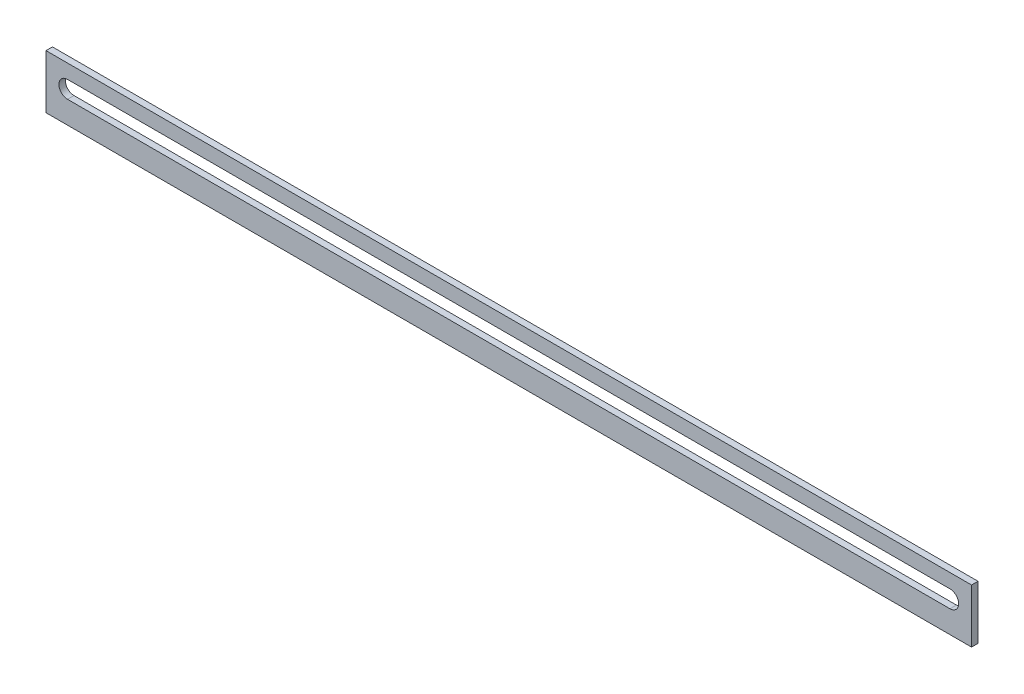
ISO-10303-21;
HEADER;
FILE_DESCRIPTION(('STEP AP214'),'2;1');
FILE_NAME('part.step','',(''),(''),'','','');
FILE_SCHEMA(('AUTOMOTIVE_DESIGN { 1 0 10303 214 1 1 1 1 }'));
ENDSEC;
DATA;
#1=APPLICATION_CONTEXT('core data for automotive mechanical design processes');
#2=APPLICATION_PROTOCOL_DEFINITION('international standard','automotive_design',2000,#1);
#3=PRODUCT_CONTEXT('',#1,'mechanical');
#4=PRODUCT('Part','Part','',(#3));
#5=PRODUCT_RELATED_PRODUCT_CATEGORY('part','',(#4));
#6=PRODUCT_DEFINITION_FORMATION('','',#4);
#7=PRODUCT_DEFINITION_CONTEXT('part definition',#1,'design');
#8=PRODUCT_DEFINITION('design','',#6,#7);
#9=PRODUCT_DEFINITION_SHAPE('','',#8);
#10=(LENGTH_UNIT() NAMED_UNIT(*) SI_UNIT(.MILLI.,.METRE.));
#11=(NAMED_UNIT(*) PLANE_ANGLE_UNIT() SI_UNIT($,.RADIAN.));
#12=(NAMED_UNIT(*) SI_UNIT($,.STERADIAN.) SOLID_ANGLE_UNIT());
#13=UNCERTAINTY_MEASURE_WITH_UNIT(LENGTH_MEASURE(1.E-05),#10,'distance_accuracy_value','');
#14=(GEOMETRIC_REPRESENTATION_CONTEXT(3) GLOBAL_UNCERTAINTY_ASSIGNED_CONTEXT((#13)) GLOBAL_UNIT_ASSIGNED_CONTEXT((#10,
#11,#12)) REPRESENTATION_CONTEXT('',''));
#15=CARTESIAN_POINT('',(0.,0.,0.));
#16=DIRECTION('',(0.,0.,1.));
#17=DIRECTION('',(1.,0.,0.));
#18=AXIS2_PLACEMENT_3D('',#15,#16,#17);
#19=CARTESIAN_POINT('',(373.84952654,7.14159266,1.5));
#20=DIRECTION('',(0.,0.,-1.));
#21=DIRECTION('',(0.,1.,0.));
#22=AXIS2_PLACEMENT_3D('',#19,#20,#21);
#23=PLANE('',#22);
#24=DIRECTION('',(-1.,0.,0.));
#25=VECTOR('',#24,1.);
#26=CARTESIAN_POINT('',(-29.64603306,-9.41999999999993,1.5));
#27=LINE('',#26,#25);
#28=CARTESIAN_POINT('',(400.35396694,-9.41999999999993,1.5));
#29=VERTEX_POINT('',#28);
#30=CARTESIAN_POINT('',(-29.64603306,-9.41999999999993,1.5));
#31=VERTEX_POINT('',#30);
#32=EDGE_CURVE('E152',#29,#31,#27,.T.);
#33=ORIENTED_EDGE('',*,*,#32,.T.);
#34=DIRECTION('',(0.,-1.,0.));
#35=VECTOR('',#34,1.);
#36=CARTESIAN_POINT('',(-29.64603306,-34.4199999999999,1.5));
#37=LINE('',#36,#35);
#38=CARTESIAN_POINT('',(-29.64603306,-34.4199999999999,1.5));
#39=VERTEX_POINT('',#38);
#40=EDGE_CURVE('E154',#31,#39,#37,.T.);
#41=ORIENTED_EDGE('',*,*,#40,.T.);
#42=DIRECTION('',(1.,0.,0.));
#43=VECTOR('',#42,1.);
#44=CARTESIAN_POINT('',(-29.64603306,-34.4199999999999,1.5));
#45=LINE('',#44,#43);
#46=CARTESIAN_POINT('',(400.35396694,-34.4199999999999,1.5));
#47=VERTEX_POINT('',#46);
#48=EDGE_CURVE('E142',#39,#47,#45,.T.);
#49=ORIENTED_EDGE('',*,*,#48,.T.);
#50=DIRECTION('',(0.,1.,0.));
#51=VECTOR('',#50,1.);
#52=CARTESIAN_POINT('',(400.35396694,-34.4199999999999,1.5));
#53=LINE('',#52,#51);
#54=EDGE_CURVE('E134',#47,#29,#53,.T.);
#55=ORIENTED_EDGE('',*,*,#54,.T.);
#56=EDGE_LOOP('',(#33,#41,#49,#55));
#57=FACE_BOUND('',#56,.T.);
#58=DIRECTION('',(1.,0.,0.));
#59=VECTOR('',#58,1.);
#60=CARTESIAN_POINT('',(-19.64603306,-24.,1.5));
#61=LINE('',#60,#59);
#62=CARTESIAN_POINT('',(-19.64603306,-24.,1.5));
#63=VERTEX_POINT('',#62);
#64=CARTESIAN_POINT('',(390.35396694,-24.,1.5));
#65=VERTEX_POINT('',#64);
#66=EDGE_CURVE('E128',#63,#65,#61,.T.);
#67=ORIENTED_EDGE('',*,*,#66,.F.);
#68=CARTESIAN_POINT('',(-19.64603306,-20.,1.5));
#69=DIRECTION('',(0.,0.,1.));
#70=DIRECTION('',(1.,0.,0.));
#71=AXIS2_PLACEMENT_3D('',#68,#69,#70);
#72=CIRCLE('',#71,4.);
#73=CARTESIAN_POINT('',(-19.64603306,-16.,1.5));
#74=VERTEX_POINT('',#73);
#75=EDGE_CURVE('E61',#74,#63,#72,.T.);
#76=ORIENTED_EDGE('',*,*,#75,.F.);
#77=DIRECTION('',(-1.,0.,0.));
#78=VECTOR('',#77,1.);
#79=CARTESIAN_POINT('',(-19.64603306,-16.,1.5));
#80=LINE('',#79,#78);
#81=CARTESIAN_POINT('',(390.35396694,-16.,1.5));
#82=VERTEX_POINT('',#81);
#83=EDGE_CURVE('E119',#82,#74,#80,.T.);
#84=ORIENTED_EDGE('',*,*,#83,.F.);
#85=CARTESIAN_POINT('',(390.35396694,-20.,1.5));
#86=DIRECTION('',(0.,0.,1.));
#87=DIRECTION('',(1.,0.,0.));
#88=AXIS2_PLACEMENT_3D('',#85,#86,#87);
#89=CIRCLE('',#88,4.);
#90=EDGE_CURVE('E122',#65,#82,#89,.T.);
#91=ORIENTED_EDGE('',*,*,#90,.F.);
#92=EDGE_LOOP('',(#67,#76,#84,#91));
#93=FACE_BOUND('',#92,.T.);
#94=ADVANCED_FACE('F37',(#57,#93),#23,.F.);
#95=CARTESIAN_POINT('',(373.84952654,7.14159266,-1.5));
#96=DIRECTION('',(0.,0.,1.));
#97=DIRECTION('',(0.,-1.,0.));
#98=AXIS2_PLACEMENT_3D('',#95,#96,#97);
#99=PLANE('',#98);
#100=DIRECTION('',(0.,-1.,0.));
#101=VECTOR('',#100,1.);
#102=CARTESIAN_POINT('',(-29.64603306,-34.4199999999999,-1.5));
#103=LINE('',#102,#101);
#104=CARTESIAN_POINT('',(-29.64603306,-9.41999999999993,-1.5));
#105=VERTEX_POINT('',#104);
#106=CARTESIAN_POINT('',(-29.64603306,-34.4199999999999,-1.5));
#107=VERTEX_POINT('',#106);
#108=EDGE_CURVE('E144',#105,#107,#103,.T.);
#109=ORIENTED_EDGE('',*,*,#108,.F.);
#110=DIRECTION('',(-1.,0.,0.));
#111=VECTOR('',#110,1.);
#112=CARTESIAN_POINT('',(-29.64603306,-9.41999999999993,-1.5));
#113=LINE('',#112,#111);
#114=CARTESIAN_POINT('',(400.35396694,-9.41999999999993,-1.5));
#115=VERTEX_POINT('',#114);
#116=EDGE_CURVE('E141',#115,#105,#113,.T.);
#117=ORIENTED_EDGE('',*,*,#116,.F.);
#118=DIRECTION('',(0.,1.,0.));
#119=VECTOR('',#118,1.);
#120=CARTESIAN_POINT('',(400.35396694,-34.4199999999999,-1.5));
#121=LINE('',#120,#119);
#122=CARTESIAN_POINT('',(400.35396694,-34.4199999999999,-1.5));
#123=VERTEX_POINT('',#122);
#124=EDGE_CURVE('E138',#123,#115,#121,.T.);
#125=ORIENTED_EDGE('',*,*,#124,.F.);
#126=DIRECTION('',(1.,0.,0.));
#127=VECTOR('',#126,1.);
#128=CARTESIAN_POINT('',(-29.64603306,-34.4199999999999,-1.5));
#129=LINE('',#128,#127);
#130=EDGE_CURVE('E147',#107,#123,#129,.T.);
#131=ORIENTED_EDGE('',*,*,#130,.F.);
#132=EDGE_LOOP('',(#109,#117,#125,#131));
#133=FACE_BOUND('',#132,.T.);
#134=CARTESIAN_POINT('',(-19.64603306,-20.,-1.5));
#135=DIRECTION('',(0.,0.,1.));
#136=DIRECTION('',(1.,0.,0.));
#137=AXIS2_PLACEMENT_3D('',#134,#135,#136);
#138=CIRCLE('',#137,4.);
#139=CARTESIAN_POINT('',(-19.64603306,-16.,-1.5));
#140=VERTEX_POINT('',#139);
#141=CARTESIAN_POINT('',(-19.64603306,-24.,-1.5));
#142=VERTEX_POINT('',#141);
#143=EDGE_CURVE('E104',#140,#142,#138,.T.);
#144=ORIENTED_EDGE('',*,*,#143,.T.);
#145=DIRECTION('',(1.,0.,0.));
#146=VECTOR('',#145,1.);
#147=CARTESIAN_POINT('',(-19.64603306,-24.,-1.5));
#148=LINE('',#147,#146);
#149=CARTESIAN_POINT('',(390.35396694,-24.,-1.5));
#150=VERTEX_POINT('',#149);
#151=EDGE_CURVE('E113',#142,#150,#148,.T.);
#152=ORIENTED_EDGE('',*,*,#151,.T.);
#153=CARTESIAN_POINT('',(390.35396694,-20.,-1.5));
#154=DIRECTION('',(0.,0.,1.));
#155=DIRECTION('',(1.,0.,0.));
#156=AXIS2_PLACEMENT_3D('',#153,#154,#155);
#157=CIRCLE('',#156,4.);
#158=CARTESIAN_POINT('',(390.35396694,-16.,-1.5));
#159=VERTEX_POINT('',#158);
#160=EDGE_CURVE('E53',#150,#159,#157,.T.);
#161=ORIENTED_EDGE('',*,*,#160,.T.);
#162=DIRECTION('',(-1.,0.,0.));
#163=VECTOR('',#162,1.);
#164=CARTESIAN_POINT('',(-19.64603306,-16.,-1.5));
#165=LINE('',#164,#163);
#166=EDGE_CURVE('E110',#159,#140,#165,.T.);
#167=ORIENTED_EDGE('',*,*,#166,.T.);
#168=EDGE_LOOP('',(#144,#152,#161,#167));
#169=FACE_BOUND('',#168,.T.);
#170=ADVANCED_FACE('F117',(#133,#169),#99,.F.);
#171=CARTESIAN_POINT('',(-29.64603306,-9.41999999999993,-1.5));
#172=DIRECTION('',(0.,1.,0.));
#173=DIRECTION('',(0.,0.,1.));
#174=AXIS2_PLACEMENT_3D('',#171,#172,#173);
#175=PLANE('',#174);
#176=ORIENTED_EDGE('',*,*,#116,.T.);
#177=DIRECTION('',(0.,0.,1.));
#178=VECTOR('',#177,1.);
#179=CARTESIAN_POINT('',(-29.64603306,-9.41999999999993,-1.5));
#180=LINE('',#179,#178);
#181=EDGE_CURVE('E159',#105,#31,#180,.T.);
#182=ORIENTED_EDGE('',*,*,#181,.T.);
#183=ORIENTED_EDGE('',*,*,#32,.F.);
#184=DIRECTION('',(0.,0.,1.));
#185=VECTOR('',#184,1.);
#186=CARTESIAN_POINT('',(400.35396694,-9.41999999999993,-1.5));
#187=LINE('',#186,#185);
#188=EDGE_CURVE('E40',#115,#29,#187,.T.);
#189=ORIENTED_EDGE('',*,*,#188,.F.);
#190=EDGE_LOOP('',(#176,#182,#183,#189));
#191=FACE_BOUND('',#190,.T.);
#192=ADVANCED_FACE('F170',(#191),#175,.T.);
#193=CARTESIAN_POINT('',(400.35396694,-34.4199999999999,-1.5));
#194=DIRECTION('',(1.,0.,0.));
#195=DIRECTION('',(0.,0.,-1.));
#196=AXIS2_PLACEMENT_3D('',#193,#194,#195);
#197=PLANE('',#196);
#198=ORIENTED_EDGE('',*,*,#54,.F.);
#199=DIRECTION('',(0.,0.,1.));
#200=VECTOR('',#199,1.);
#201=CARTESIAN_POINT('',(400.35396694,-34.4199999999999,-1.5));
#202=LINE('',#201,#200);
#203=EDGE_CURVE('E11',#123,#47,#202,.T.);
#204=ORIENTED_EDGE('',*,*,#203,.F.);
#205=ORIENTED_EDGE('',*,*,#124,.T.);
#206=ORIENTED_EDGE('',*,*,#188,.T.);
#207=EDGE_LOOP('',(#198,#204,#205,#206));
#208=FACE_BOUND('',#207,.T.);
#209=ADVANCED_FACE('F167',(#208),#197,.T.);
#210=CARTESIAN_POINT('',(-29.64603306,-34.4199999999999,-1.5));
#211=DIRECTION('',(0.,-1.,0.));
#212=DIRECTION('',(0.,0.,-1.));
#213=AXIS2_PLACEMENT_3D('',#210,#211,#212);
#214=PLANE('',#213);
#215=ORIENTED_EDGE('',*,*,#48,.F.);
#216=DIRECTION('',(0.,0.,1.));
#217=VECTOR('',#216,1.);
#218=CARTESIAN_POINT('',(-29.64603306,-34.4199999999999,-1.5));
#219=LINE('',#218,#217);
#220=EDGE_CURVE('E45',#107,#39,#219,.T.);
#221=ORIENTED_EDGE('',*,*,#220,.F.);
#222=ORIENTED_EDGE('',*,*,#130,.T.);
#223=ORIENTED_EDGE('',*,*,#203,.T.);
#224=EDGE_LOOP('',(#215,#221,#222,#223));
#225=FACE_BOUND('',#224,.T.);
#226=ADVANCED_FACE('F175',(#225),#214,.T.);
#227=CARTESIAN_POINT('',(-29.64603306,-34.4199999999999,-1.5));
#228=DIRECTION('',(-1.,0.,0.));
#229=DIRECTION('',(0.,0.,1.));
#230=AXIS2_PLACEMENT_3D('',#227,#228,#229);
#231=PLANE('',#230);
#232=ORIENTED_EDGE('',*,*,#40,.F.);
#233=ORIENTED_EDGE('',*,*,#181,.F.);
#234=ORIENTED_EDGE('',*,*,#108,.T.);
#235=ORIENTED_EDGE('',*,*,#220,.T.);
#236=EDGE_LOOP('',(#232,#233,#234,#235));
#237=FACE_BOUND('',#236,.T.);
#238=ADVANCED_FACE('F180',(#237),#231,.T.);
#239=CARTESIAN_POINT('',(-19.64603306,-20.,-1.5));
#240=DIRECTION('',(0.,0.,1.));
#241=DIRECTION('',(1.,0.,0.));
#242=AXIS2_PLACEMENT_3D('',#239,#240,#241);
#243=CYLINDRICAL_SURFACE('',#242,4.);
#244=ORIENTED_EDGE('',*,*,#75,.T.);
#245=DIRECTION('',(0.,0.,1.));
#246=VECTOR('',#245,1.);
#247=CARTESIAN_POINT('',(-19.64603306,-24.,-1.5));
#248=LINE('',#247,#246);
#249=EDGE_CURVE('E100',#142,#63,#248,.T.);
#250=ORIENTED_EDGE('',*,*,#249,.F.);
#251=ORIENTED_EDGE('',*,*,#143,.F.);
#252=DIRECTION('',(0.,0.,1.));
#253=VECTOR('',#252,1.);
#254=CARTESIAN_POINT('',(-19.64603306,-16.,-1.5));
#255=LINE('',#254,#253);
#256=EDGE_CURVE('E132',#140,#74,#255,.T.);
#257=ORIENTED_EDGE('',*,*,#256,.T.);
#258=EDGE_LOOP('',(#244,#250,#251,#257));
#259=FACE_BOUND('',#258,.T.);
#260=ADVANCED_FACE('F102',(#259),#243,.F.);
#261=CARTESIAN_POINT('',(-19.64603306,-16.,-1.5));
#262=DIRECTION('',(0.,1.,0.));
#263=DIRECTION('',(-1.,0.,0.));
#264=AXIS2_PLACEMENT_3D('',#261,#262,#263);
#265=PLANE('',#264);
#266=ORIENTED_EDGE('',*,*,#83,.T.);
#267=ORIENTED_EDGE('',*,*,#256,.F.);
#268=ORIENTED_EDGE('',*,*,#166,.F.);
#269=DIRECTION('',(0.,0.,1.));
#270=VECTOR('',#269,1.);
#271=CARTESIAN_POINT('',(390.35396694,-16.,-1.5));
#272=LINE('',#271,#270);
#273=EDGE_CURVE('E135',#159,#82,#272,.T.);
#274=ORIENTED_EDGE('',*,*,#273,.T.);
#275=EDGE_LOOP('',(#266,#267,#268,#274));
#276=FACE_BOUND('',#275,.T.);
#277=ADVANCED_FACE('F187',(#276),#265,.F.);
#278=CARTESIAN_POINT('',(390.35396694,-20.,-1.5));
#279=DIRECTION('',(0.,0.,1.));
#280=DIRECTION('',(1.,0.,0.));
#281=AXIS2_PLACEMENT_3D('',#278,#279,#280);
#282=CYLINDRICAL_SURFACE('',#281,4.);
#283=ORIENTED_EDGE('',*,*,#90,.T.);
#284=ORIENTED_EDGE('',*,*,#273,.F.);
#285=ORIENTED_EDGE('',*,*,#160,.F.);
#286=DIRECTION('',(0.,0.,1.));
#287=VECTOR('',#286,1.);
#288=CARTESIAN_POINT('',(390.35396694,-24.,-1.5));
#289=LINE('',#288,#287);
#290=EDGE_CURVE('E109',#150,#65,#289,.T.);
#291=ORIENTED_EDGE('',*,*,#290,.T.);
#292=EDGE_LOOP('',(#283,#284,#285,#291));
#293=FACE_BOUND('',#292,.T.);
#294=ADVANCED_FACE('F227',(#293),#282,.F.);
#295=CARTESIAN_POINT('',(-19.64603306,-24.,-1.5));
#296=DIRECTION('',(0.,-1.,0.));
#297=DIRECTION('',(1.,0.,0.));
#298=AXIS2_PLACEMENT_3D('',#295,#296,#297);
#299=PLANE('',#298);
#300=ORIENTED_EDGE('',*,*,#66,.T.);
#301=ORIENTED_EDGE('',*,*,#290,.F.);
#302=ORIENTED_EDGE('',*,*,#151,.F.);
#303=ORIENTED_EDGE('',*,*,#249,.T.);
#304=EDGE_LOOP('',(#300,#301,#302,#303));
#305=FACE_BOUND('',#304,.T.);
#306=ADVANCED_FACE('F114',(#305),#299,.F.);
#307=CLOSED_SHELL('',(#94,#170,#192,#209,#226,#238,#260,#277,#294,#306));
#308=MANIFOLD_SOLID_BREP('B2',#307);
#309=ADVANCED_BREP_SHAPE_REPRESENTATION('',(#18,#308),#14);
#310=SHAPE_DEFINITION_REPRESENTATION(#9,#309);
ENDSEC;
END-ISO-10303-21;
